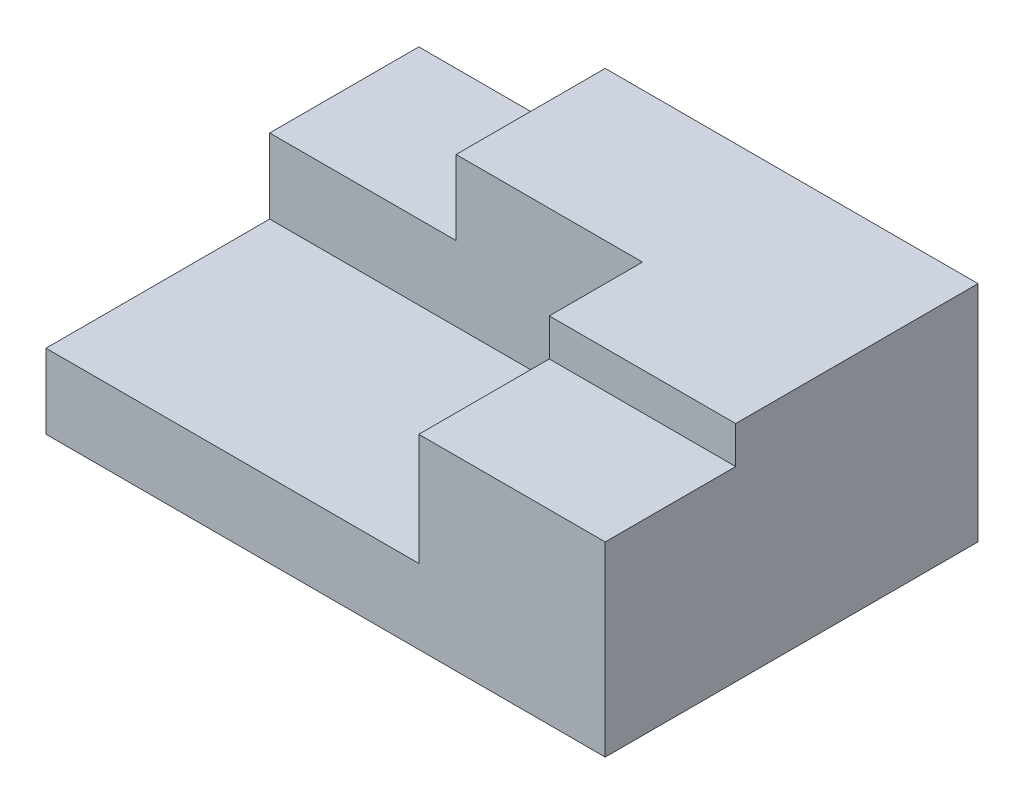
ISO-10303-21;
HEADER;
FILE_DESCRIPTION(('STEP AP214'),'2;1');
FILE_NAME('part.step','',(''),(''),'','','');
FILE_SCHEMA(('AUTOMOTIVE_DESIGN { 1 0 10303 214 1 1 1 1 }'));
ENDSEC;
DATA;
#1=APPLICATION_CONTEXT('core data for automotive mechanical design processes');
#2=APPLICATION_PROTOCOL_DEFINITION('international standard','automotive_design',2000,#1);
#3=PRODUCT_CONTEXT('',#1,'mechanical');
#4=PRODUCT('Part','Part','',(#3));
#5=PRODUCT_RELATED_PRODUCT_CATEGORY('part','',(#4));
#6=PRODUCT_DEFINITION_FORMATION('','',#4);
#7=PRODUCT_DEFINITION_CONTEXT('part definition',#1,'design');
#8=PRODUCT_DEFINITION('design','',#6,#7);
#9=PRODUCT_DEFINITION_SHAPE('','',#8);
#10=(LENGTH_UNIT() NAMED_UNIT(*) SI_UNIT(.MILLI.,.METRE.));
#11=(NAMED_UNIT(*) PLANE_ANGLE_UNIT() SI_UNIT($,.RADIAN.));
#12=(NAMED_UNIT(*) SI_UNIT($,.STERADIAN.) SOLID_ANGLE_UNIT());
#13=UNCERTAINTY_MEASURE_WITH_UNIT(LENGTH_MEASURE(1.E-05),#10,'distance_accuracy_value','');
#14=(GEOMETRIC_REPRESENTATION_CONTEXT(3) GLOBAL_UNCERTAINTY_ASSIGNED_CONTEXT((#13)) GLOBAL_UNIT_ASSIGNED_CONTEXT((#10,
#11,#12)) REPRESENTATION_CONTEXT('',''));
#15=CARTESIAN_POINT('',(0.,0.,0.));
#16=DIRECTION('',(0.,0.,1.));
#17=DIRECTION('',(1.,0.,0.));
#18=AXIS2_PLACEMENT_3D('',#15,#16,#17);
#19=CARTESIAN_POINT('',(0.,60.,0.));
#20=DIRECTION('',(1.,0.,0.));
#21=DIRECTION('',(0.,0.,-1.));
#22=AXIS2_PLACEMENT_3D('',#19,#20,#21);
#23=PLANE('',#22);
#24=DIRECTION('',(0.,0.,1.));
#25=VECTOR('',#24,1.);
#26=CARTESIAN_POINT('',(0.,40.,-100.));
#27=LINE('',#26,#25);
#28=CARTESIAN_POINT('',(0.,40.,-100.));
#29=VERTEX_POINT('',#28);
#30=CARTESIAN_POINT('',(0.,40.,-60.));
#31=VERTEX_POINT('',#30);
#32=EDGE_CURVE('E55',#29,#31,#27,.T.);
#33=ORIENTED_EDGE('',*,*,#32,.F.);
#34=DIRECTION('',(0.,-1.,0.));
#35=VECTOR('',#34,1.);
#36=CARTESIAN_POINT('',(0.,60.,-100.));
#37=LINE('',#36,#35);
#38=CARTESIAN_POINT('',(0.,0.,-100.));
#39=VERTEX_POINT('',#38);
#40=EDGE_CURVE('E152',#29,#39,#37,.T.);
#41=ORIENTED_EDGE('',*,*,#40,.T.);
#42=DIRECTION('',(0.,0.,1.));
#43=VECTOR('',#42,1.);
#44=CARTESIAN_POINT('',(0.,0.,0.));
#45=LINE('',#44,#43);
#46=CARTESIAN_POINT('',(0.,0.,0.));
#47=VERTEX_POINT('',#46);
#48=EDGE_CURVE('E153',#39,#47,#45,.T.);
#49=ORIENTED_EDGE('',*,*,#48,.T.);
#50=DIRECTION('',(0.,-1.,0.));
#51=VECTOR('',#50,1.);
#52=CARTESIAN_POINT('',(0.,60.,0.));
#53=LINE('',#52,#51);
#54=CARTESIAN_POINT('',(0.,20.,0.));
#55=VERTEX_POINT('',#54);
#56=EDGE_CURVE('E11',#55,#47,#53,.T.);
#57=ORIENTED_EDGE('',*,*,#56,.F.);
#58=DIRECTION('',(0.,0.,1.));
#59=VECTOR('',#58,1.);
#60=CARTESIAN_POINT('',(0.,20.,0.));
#61=LINE('',#60,#59);
#62=CARTESIAN_POINT('',(0.,20.,-60.));
#63=VERTEX_POINT('',#62);
#64=EDGE_CURVE('E213',#63,#55,#61,.T.);
#65=ORIENTED_EDGE('',*,*,#64,.F.);
#66=DIRECTION('',(0.,1.,0.));
#67=VECTOR('',#66,1.);
#68=CARTESIAN_POINT('',(0.,20.,-60.));
#69=LINE('',#68,#67);
#70=EDGE_CURVE('E140',#63,#31,#69,.T.);
#71=ORIENTED_EDGE('',*,*,#70,.T.);
#72=EDGE_LOOP('',(#33,#41,#49,#57,#65,#71));
#73=FACE_BOUND('',#72,.T.);
#74=ADVANCED_FACE('F33',(#73),#23,.F.);
#75=CARTESIAN_POINT('',(0.,60.,0.));
#76=DIRECTION('',(0.,0.,-1.));
#77=DIRECTION('',(-1.,0.,0.));
#78=AXIS2_PLACEMENT_3D('',#75,#76,#77);
#79=PLANE('',#78);
#80=DIRECTION('',(0.,-1.,0.));
#81=VECTOR('',#80,1.);
#82=CARTESIAN_POINT('',(150.,60.,0.));
#83=LINE('',#82,#81);
#84=CARTESIAN_POINT('',(150.,50.,0.));
#85=VERTEX_POINT('',#84);
#86=CARTESIAN_POINT('',(150.,0.,0.));
#87=VERTEX_POINT('',#86);
#88=EDGE_CURVE('E40',#85,#87,#83,.T.);
#89=ORIENTED_EDGE('',*,*,#88,.F.);
#90=DIRECTION('',(1.,0.,0.));
#91=VECTOR('',#90,1.);
#92=CARTESIAN_POINT('',(100.,50.,0.));
#93=LINE('',#92,#91);
#94=CARTESIAN_POINT('',(100.,50.,0.));
#95=VERTEX_POINT('',#94);
#96=EDGE_CURVE('E116',#95,#85,#93,.T.);
#97=ORIENTED_EDGE('',*,*,#96,.F.);
#98=DIRECTION('',(0.,1.,0.));
#99=VECTOR('',#98,1.);
#100=CARTESIAN_POINT('',(100.,20.,0.));
#101=LINE('',#100,#99);
#102=CARTESIAN_POINT('',(100.,20.,0.));
#103=VERTEX_POINT('',#102);
#104=EDGE_CURVE('E128',#103,#95,#101,.T.);
#105=ORIENTED_EDGE('',*,*,#104,.F.);
#106=DIRECTION('',(1.,0.,0.));
#107=VECTOR('',#106,1.);
#108=CARTESIAN_POINT('',(0.,20.,0.));
#109=LINE('',#108,#107);
#110=EDGE_CURVE('E215',#55,#103,#109,.T.);
#111=ORIENTED_EDGE('',*,*,#110,.F.);
#112=ORIENTED_EDGE('',*,*,#56,.T.);
#113=DIRECTION('',(1.,0.,0.));
#114=VECTOR('',#113,1.);
#115=CARTESIAN_POINT('',(0.,0.,0.));
#116=LINE('',#115,#114);
#117=EDGE_CURVE('E156',#47,#87,#116,.T.);
#118=ORIENTED_EDGE('',*,*,#117,.T.);
#119=EDGE_LOOP('',(#89,#97,#105,#111,#112,#118));
#120=FACE_BOUND('',#119,.T.);
#121=ADVANCED_FACE('F126',(#120),#79,.F.);
#122=CARTESIAN_POINT('',(150.,60.,0.));
#123=DIRECTION('',(-1.,0.,0.));
#124=DIRECTION('',(0.,0.,1.));
#125=AXIS2_PLACEMENT_3D('',#122,#123,#124);
#126=PLANE('',#125);
#127=DIRECTION('',(0.,0.,-1.));
#128=VECTOR('',#127,1.);
#129=CARTESIAN_POINT('',(150.,60.,0.));
#130=LINE('',#129,#128);
#131=CARTESIAN_POINT('',(150.,60.,-35.));
#132=VERTEX_POINT('',#131);
#133=CARTESIAN_POINT('',(150.,60.,-100.));
#134=VERTEX_POINT('',#133);
#135=EDGE_CURVE('E146',#132,#134,#130,.T.);
#136=ORIENTED_EDGE('',*,*,#135,.F.);
#137=DIRECTION('',(0.,1.,0.));
#138=VECTOR('',#137,1.);
#139=CARTESIAN_POINT('',(150.,50.,-35.));
#140=LINE('',#139,#138);
#141=CARTESIAN_POINT('',(150.,50.,-35.));
#142=VERTEX_POINT('',#141);
#143=EDGE_CURVE('E183',#142,#132,#140,.T.);
#144=ORIENTED_EDGE('',*,*,#143,.F.);
#145=DIRECTION('',(0.,0.,-1.));
#146=VECTOR('',#145,1.);
#147=CARTESIAN_POINT('',(150.,50.,0.));
#148=LINE('',#147,#146);
#149=EDGE_CURVE('E130',#85,#142,#148,.T.);
#150=ORIENTED_EDGE('',*,*,#149,.F.);
#151=ORIENTED_EDGE('',*,*,#88,.T.);
#152=DIRECTION('',(0.,0.,-1.));
#153=VECTOR('',#152,1.);
#154=CARTESIAN_POINT('',(150.,0.,0.));
#155=LINE('',#154,#153);
#156=CARTESIAN_POINT('',(150.,0.,-100.));
#157=VERTEX_POINT('',#156);
#158=EDGE_CURVE('E158',#87,#157,#155,.T.);
#159=ORIENTED_EDGE('',*,*,#158,.T.);
#160=DIRECTION('',(0.,-1.,0.));
#161=VECTOR('',#160,1.);
#162=CARTESIAN_POINT('',(150.,60.,-100.));
#163=LINE('',#162,#161);
#164=EDGE_CURVE('E163',#134,#157,#163,.T.);
#165=ORIENTED_EDGE('',*,*,#164,.F.);
#166=EDGE_LOOP('',(#136,#144,#150,#151,#159,#165));
#167=FACE_BOUND('',#166,.T.);
#168=ADVANCED_FACE('F167',(#167),#126,.F.);
#169=CARTESIAN_POINT('',(0.,60.,-100.));
#170=DIRECTION('',(0.,0.,1.));
#171=DIRECTION('',(1.,0.,0.));
#172=AXIS2_PLACEMENT_3D('',#169,#170,#171);
#173=PLANE('',#172);
#174=DIRECTION('',(-1.,0.,0.));
#175=VECTOR('',#174,1.);
#176=CARTESIAN_POINT('',(0.,40.,-100.));
#177=LINE('',#176,#175);
#178=CARTESIAN_POINT('',(50.,40.,-100.));
#179=VERTEX_POINT('',#178);
#180=EDGE_CURVE('E206',#179,#29,#177,.T.);
#181=ORIENTED_EDGE('',*,*,#180,.F.);
#182=DIRECTION('',(0.,1.,0.));
#183=VECTOR('',#182,1.);
#184=CARTESIAN_POINT('',(50.,40.,-100.));
#185=LINE('',#184,#183);
#186=CARTESIAN_POINT('',(50.,60.,-100.));
#187=VERTEX_POINT('',#186);
#188=EDGE_CURVE('E210',#179,#187,#185,.T.);
#189=ORIENTED_EDGE('',*,*,#188,.T.);
#190=DIRECTION('',(-1.,0.,0.));
#191=VECTOR('',#190,1.);
#192=CARTESIAN_POINT('',(0.,60.,-100.));
#193=LINE('',#192,#191);
#194=EDGE_CURVE('E148',#134,#187,#193,.T.);
#195=ORIENTED_EDGE('',*,*,#194,.F.);
#196=ORIENTED_EDGE('',*,*,#164,.T.);
#197=DIRECTION('',(-1.,0.,0.));
#198=VECTOR('',#197,1.);
#199=CARTESIAN_POINT('',(0.,0.,-100.));
#200=LINE('',#199,#198);
#201=EDGE_CURVE('E149',#157,#39,#200,.T.);
#202=ORIENTED_EDGE('',*,*,#201,.T.);
#203=ORIENTED_EDGE('',*,*,#40,.F.);
#204=EDGE_LOOP('',(#181,#189,#195,#196,#202,#203));
#205=FACE_BOUND('',#204,.T.);
#206=ADVANCED_FACE('F180',(#205),#173,.F.);
#207=CARTESIAN_POINT('',(0.,60.,0.));
#208=DIRECTION('',(0.,-1.,0.));
#209=DIRECTION('',(0.,0.,-1.));
#210=AXIS2_PLACEMENT_3D('',#207,#208,#209);
#211=PLANE('',#210);
#212=DIRECTION('',(0.,0.,-1.));
#213=VECTOR('',#212,1.);
#214=CARTESIAN_POINT('',(100.,60.,0.));
#215=LINE('',#214,#213);
#216=CARTESIAN_POINT('',(100.,60.,-35.));
#217=VERTEX_POINT('',#216);
#218=CARTESIAN_POINT('',(100.,60.,-60.));
#219=VERTEX_POINT('',#218);
#220=EDGE_CURVE('E190',#217,#219,#215,.T.);
#221=ORIENTED_EDGE('',*,*,#220,.F.);
#222=DIRECTION('',(-1.,0.,0.));
#223=VECTOR('',#222,1.);
#224=CARTESIAN_POINT('',(100.,60.,-35.));
#225=LINE('',#224,#223);
#226=EDGE_CURVE('E121',#132,#217,#225,.T.);
#227=ORIENTED_EDGE('',*,*,#226,.F.);
#228=ORIENTED_EDGE('',*,*,#135,.T.);
#229=ORIENTED_EDGE('',*,*,#194,.T.);
#230=DIRECTION('',(0.,0.,-1.));
#231=VECTOR('',#230,1.);
#232=CARTESIAN_POINT('',(50.,60.,-100.));
#233=LINE('',#232,#231);
#234=CARTESIAN_POINT('',(50.,60.,-60.));
#235=VERTEX_POINT('',#234);
#236=EDGE_CURVE('E198',#235,#187,#233,.T.);
#237=ORIENTED_EDGE('',*,*,#236,.F.);
#238=DIRECTION('',(-1.,0.,0.));
#239=VECTOR('',#238,1.);
#240=CARTESIAN_POINT('',(0.,60.,-60.));
#241=LINE('',#240,#239);
#242=EDGE_CURVE('E216',#219,#235,#241,.T.);
#243=ORIENTED_EDGE('',*,*,#242,.F.);
#244=EDGE_LOOP('',(#221,#227,#228,#229,#237,#243));
#245=FACE_BOUND('',#244,.T.);
#246=ADVANCED_FACE('F187',(#245),#211,.F.);
#247=CARTESIAN_POINT('',(0.,0.,0.));
#248=DIRECTION('',(0.,-1.,0.));
#249=DIRECTION('',(0.,0.,-1.));
#250=AXIS2_PLACEMENT_3D('',#247,#248,#249);
#251=PLANE('',#250);
#252=ORIENTED_EDGE('',*,*,#48,.F.);
#253=ORIENTED_EDGE('',*,*,#201,.F.);
#254=ORIENTED_EDGE('',*,*,#158,.F.);
#255=ORIENTED_EDGE('',*,*,#117,.F.);
#256=EDGE_LOOP('',(#252,#253,#254,#255));
#257=FACE_BOUND('',#256,.T.);
#258=ADVANCED_FACE('F176',(#257),#251,.T.);
#259=CARTESIAN_POINT('',(0.,20.,-60.));
#260=DIRECTION('',(0.,0.,-1.));
#261=DIRECTION('',(-1.,0.,0.));
#262=AXIS2_PLACEMENT_3D('',#259,#260,#261);
#263=PLANE('',#262);
#264=ORIENTED_EDGE('',*,*,#242,.T.);
#265=DIRECTION('',(0.,1.,0.));
#266=VECTOR('',#265,1.);
#267=CARTESIAN_POINT('',(50.,40.,-60.));
#268=LINE('',#267,#266);
#269=CARTESIAN_POINT('',(50.,40.,-60.));
#270=VERTEX_POINT('',#269);
#271=EDGE_CURVE('E208',#270,#235,#268,.T.);
#272=ORIENTED_EDGE('',*,*,#271,.F.);
#273=DIRECTION('',(1.,0.,0.));
#274=VECTOR('',#273,1.);
#275=CARTESIAN_POINT('',(0.,40.,-60.));
#276=LINE('',#275,#274);
#277=EDGE_CURVE('E201',#31,#270,#276,.T.);
#278=ORIENTED_EDGE('',*,*,#277,.F.);
#279=ORIENTED_EDGE('',*,*,#70,.F.);
#280=DIRECTION('',(-1.,0.,0.));
#281=VECTOR('',#280,1.);
#282=CARTESIAN_POINT('',(0.,20.,-60.));
#283=LINE('',#282,#281);
#284=CARTESIAN_POINT('',(100.,20.,-60.));
#285=VERTEX_POINT('',#284);
#286=EDGE_CURVE('E137',#285,#63,#283,.T.);
#287=ORIENTED_EDGE('',*,*,#286,.F.);
#288=DIRECTION('',(0.,1.,0.));
#289=VECTOR('',#288,1.);
#290=CARTESIAN_POINT('',(100.,20.,-60.));
#291=LINE('',#290,#289);
#292=EDGE_CURVE('E136',#285,#219,#291,.T.);
#293=ORIENTED_EDGE('',*,*,#292,.T.);
#294=EDGE_LOOP('',(#264,#272,#278,#279,#287,#293));
#295=FACE_BOUND('',#294,.T.);
#296=ADVANCED_FACE('F226',(#295),#263,.F.);
#297=CARTESIAN_POINT('',(100.,20.,0.));
#298=DIRECTION('',(1.,0.,0.));
#299=DIRECTION('',(0.,0.,-1.));
#300=AXIS2_PLACEMENT_3D('',#297,#298,#299);
#301=PLANE('',#300);
#302=DIRECTION('',(0.,0.,1.));
#303=VECTOR('',#302,1.);
#304=CARTESIAN_POINT('',(100.,50.,0.));
#305=LINE('',#304,#303);
#306=CARTESIAN_POINT('',(100.,50.,-35.));
#307=VERTEX_POINT('',#306);
#308=EDGE_CURVE('E113',#307,#95,#305,.T.);
#309=ORIENTED_EDGE('',*,*,#308,.F.);
#310=DIRECTION('',(0.,1.,0.));
#311=VECTOR('',#310,1.);
#312=CARTESIAN_POINT('',(100.,50.,-35.));
#313=LINE('',#312,#311);
#314=EDGE_CURVE('E196',#307,#217,#313,.T.);
#315=ORIENTED_EDGE('',*,*,#314,.T.);
#316=ORIENTED_EDGE('',*,*,#220,.T.);
#317=ORIENTED_EDGE('',*,*,#292,.F.);
#318=DIRECTION('',(0.,0.,-1.));
#319=VECTOR('',#318,1.);
#320=CARTESIAN_POINT('',(100.,20.,0.));
#321=LINE('',#320,#319);
#322=EDGE_CURVE('E134',#103,#285,#321,.T.);
#323=ORIENTED_EDGE('',*,*,#322,.F.);
#324=ORIENTED_EDGE('',*,*,#104,.T.);
#325=EDGE_LOOP('',(#309,#315,#316,#317,#323,#324));
#326=FACE_BOUND('',#325,.T.);
#327=ADVANCED_FACE('F132',(#326),#301,.F.);
#328=CARTESIAN_POINT('',(0.,20.,0.));
#329=DIRECTION('',(0.,-1.,0.));
#330=DIRECTION('',(0.,0.,-1.));
#331=AXIS2_PLACEMENT_3D('',#328,#329,#330);
#332=PLANE('',#331);
#333=ORIENTED_EDGE('',*,*,#64,.T.);
#334=ORIENTED_EDGE('',*,*,#110,.T.);
#335=ORIENTED_EDGE('',*,*,#322,.T.);
#336=ORIENTED_EDGE('',*,*,#286,.T.);
#337=EDGE_LOOP('',(#333,#334,#335,#336));
#338=FACE_BOUND('',#337,.T.);
#339=ADVANCED_FACE('F229',(#338),#332,.F.);
#340=CARTESIAN_POINT('',(50.,40.,-100.));
#341=DIRECTION('',(1.,0.,0.));
#342=DIRECTION('',(0.,0.,-1.));
#343=AXIS2_PLACEMENT_3D('',#340,#341,#342);
#344=PLANE('',#343);
#345=ORIENTED_EDGE('',*,*,#236,.T.);
#346=ORIENTED_EDGE('',*,*,#188,.F.);
#347=DIRECTION('',(0.,0.,-1.));
#348=VECTOR('',#347,1.);
#349=CARTESIAN_POINT('',(50.,40.,-100.));
#350=LINE('',#349,#348);
#351=EDGE_CURVE('E203',#270,#179,#350,.T.);
#352=ORIENTED_EDGE('',*,*,#351,.F.);
#353=ORIENTED_EDGE('',*,*,#271,.T.);
#354=EDGE_LOOP('',(#345,#346,#352,#353));
#355=FACE_BOUND('',#354,.T.);
#356=ADVANCED_FACE('F231',(#355),#344,.F.);
#357=CARTESIAN_POINT('',(0.,40.,0.));
#358=DIRECTION('',(0.,1.,0.));
#359=DIRECTION('',(0.,0.,1.));
#360=AXIS2_PLACEMENT_3D('',#357,#358,#359);
#361=PLANE('',#360);
#362=ORIENTED_EDGE('',*,*,#32,.T.);
#363=ORIENTED_EDGE('',*,*,#277,.T.);
#364=ORIENTED_EDGE('',*,*,#351,.T.);
#365=ORIENTED_EDGE('',*,*,#180,.T.);
#366=EDGE_LOOP('',(#362,#363,#364,#365));
#367=FACE_BOUND('',#366,.T.);
#368=ADVANCED_FACE('F237',(#367),#361,.T.);
#369=CARTESIAN_POINT('',(100.,50.,-35.));
#370=DIRECTION('',(0.,0.,-1.));
#371=DIRECTION('',(-1.,0.,0.));
#372=AXIS2_PLACEMENT_3D('',#369,#370,#371);
#373=PLANE('',#372);
#374=ORIENTED_EDGE('',*,*,#226,.T.);
#375=ORIENTED_EDGE('',*,*,#314,.F.);
#376=DIRECTION('',(-1.,0.,0.));
#377=VECTOR('',#376,1.);
#378=CARTESIAN_POINT('',(100.,50.,-35.));
#379=LINE('',#378,#377);
#380=EDGE_CURVE('E47',#142,#307,#379,.T.);
#381=ORIENTED_EDGE('',*,*,#380,.F.);
#382=ORIENTED_EDGE('',*,*,#143,.T.);
#383=EDGE_LOOP('',(#374,#375,#381,#382));
#384=FACE_BOUND('',#383,.T.);
#385=ADVANCED_FACE('F277',(#384),#373,.F.);
#386=CARTESIAN_POINT('',(0.,50.,0.));
#387=DIRECTION('',(0.,-1.,0.));
#388=DIRECTION('',(0.,0.,-1.));
#389=AXIS2_PLACEMENT_3D('',#386,#387,#388);
#390=PLANE('',#389);
#391=ORIENTED_EDGE('',*,*,#308,.T.);
#392=ORIENTED_EDGE('',*,*,#96,.T.);
#393=ORIENTED_EDGE('',*,*,#149,.T.);
#394=ORIENTED_EDGE('',*,*,#380,.T.);
#395=EDGE_LOOP('',(#391,#392,#393,#394));
#396=FACE_BOUND('',#395,.T.);
#397=ADVANCED_FACE('F115',(#396),#390,.F.);
#398=CLOSED_SHELL('',(#74,#121,#168,#206,#246,#258,#296,#327,#339,#356,#368,#385,#397));
#399=MANIFOLD_SOLID_BREP('B2',#398);
#400=ADVANCED_BREP_SHAPE_REPRESENTATION('',(#18,#399),#14);
#401=SHAPE_DEFINITION_REPRESENTATION(#9,#400);
ENDSEC;
END-ISO-10303-21;
